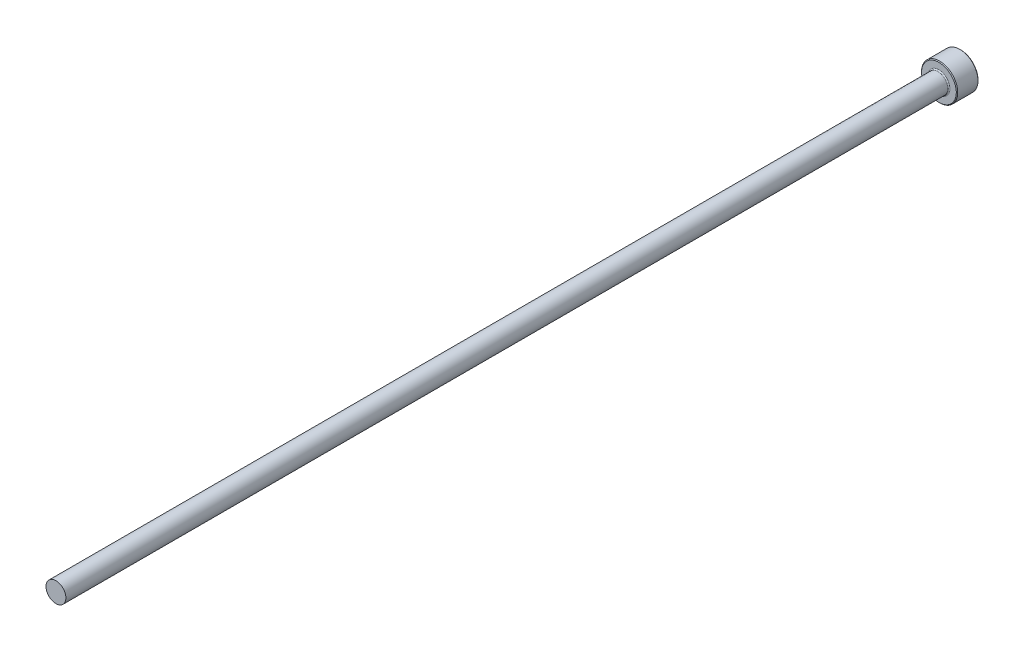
ISO-10303-21;
HEADER;
FILE_DESCRIPTION(('STEP AP214'),'2;1');
FILE_NAME('part.step','',(''),(''),'','','');
FILE_SCHEMA(('AUTOMOTIVE_DESIGN { 1 0 10303 214 1 1 1 1 }'));
ENDSEC;
DATA;
#1=APPLICATION_CONTEXT('core data for automotive mechanical design processes');
#2=APPLICATION_PROTOCOL_DEFINITION('international standard','automotive_design',2000,#1);
#3=PRODUCT_CONTEXT('',#1,'mechanical');
#4=PRODUCT('Part','Part','',(#3));
#5=PRODUCT_RELATED_PRODUCT_CATEGORY('part','',(#4));
#6=PRODUCT_DEFINITION_FORMATION('','',#4);
#7=PRODUCT_DEFINITION_CONTEXT('part definition',#1,'design');
#8=PRODUCT_DEFINITION('design','',#6,#7);
#9=PRODUCT_DEFINITION_SHAPE('','',#8);
#10=(LENGTH_UNIT() NAMED_UNIT(*) SI_UNIT(.MILLI.,.METRE.));
#11=(NAMED_UNIT(*) PLANE_ANGLE_UNIT() SI_UNIT($,.RADIAN.));
#12=(NAMED_UNIT(*) SI_UNIT($,.STERADIAN.) SOLID_ANGLE_UNIT());
#13=UNCERTAINTY_MEASURE_WITH_UNIT(LENGTH_MEASURE(1.E-05),#10,'distance_accuracy_value','');
#14=(GEOMETRIC_REPRESENTATION_CONTEXT(3) GLOBAL_UNCERTAINTY_ASSIGNED_CONTEXT((#13)) GLOBAL_UNIT_ASSIGNED_CONTEXT((#10,
#11,#12)) REPRESENTATION_CONTEXT('',''));
#15=CARTESIAN_POINT('',(0.,0.,0.));
#16=DIRECTION('',(0.,0.,1.));
#17=DIRECTION('',(1.,0.,0.));
#18=AXIS2_PLACEMENT_3D('',#15,#16,#17);
#19=CARTESIAN_POINT('',(0.,2.74999999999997,250.));
#20=DIRECTION('',(0.,0.,-1.));
#21=DIRECTION('',(-1.,0.,0.));
#22=AXIS2_PLACEMENT_3D('',#19,#20,#21);
#23=PLANE('',#22);
#24=CARTESIAN_POINT('',(0.,0.,250.));
#25=DIRECTION('',(0.,0.,1.));
#26=DIRECTION('',(1.,0.,0.));
#27=AXIS2_PLACEMENT_3D('',#24,#25,#26);
#28=CIRCLE('',#27,2.74999999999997);
#29=CARTESIAN_POINT('',(2.74999999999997,0.,250.));
#30=VERTEX_POINT('',#29);
#31=EDGE_CURVE('E50',#30,#30,#28,.T.);
#32=ORIENTED_EDGE('',*,*,#31,.T.);
#33=EDGE_LOOP('',(#32));
#34=FACE_BOUND('',#33,.T.);
#35=ADVANCED_FACE('F30',(#34),#23,.F.);
#36=CARTESIAN_POINT('',(0.,0.,109.050628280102));
#37=DIRECTION('',(0.,0.,1.));
#38=DIRECTION('',(1.,0.,0.));
#39=AXIS2_PLACEMENT_3D('',#36,#37,#38);
#40=CYLINDRICAL_SURFACE('',#39,2.74999999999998);
#41=ORIENTED_EDGE('',*,*,#31,.F.);
#42=EDGE_LOOP('',(#41));
#43=FACE_BOUND('',#42,.T.);
#44=CARTESIAN_POINT('',(0.,0.,6.3));
#45=DIRECTION('',(0.,0.,1.));
#46=DIRECTION('',(1.,0.,0.));
#47=AXIS2_PLACEMENT_3D('',#44,#45,#46);
#48=CIRCLE('',#47,2.75);
#49=CARTESIAN_POINT('',(2.75,0.,6.3));
#50=VERTEX_POINT('',#49);
#51=EDGE_CURVE('E53',#50,#50,#48,.T.);
#52=ORIENTED_EDGE('',*,*,#51,.T.);
#53=EDGE_LOOP('',(#52));
#54=FACE_BOUND('',#53,.T.);
#55=ADVANCED_FACE('F73',(#43,#54),#40,.T.);
#56=CARTESIAN_POINT('',(0.,0.,6.3));
#57=DIRECTION('',(0.,0.,1.));
#58=DIRECTION('',(1.,0.,0.));
#59=AXIS2_PLACEMENT_3D('',#56,#57,#58);
#60=TOROIDAL_SURFACE('',#59,3.05,0.3);
#61=ORIENTED_EDGE('',*,*,#51,.F.);
#62=EDGE_LOOP('',(#61));
#63=FACE_BOUND('',#62,.T.);
#64=CARTESIAN_POINT('',(0.,0.,6.00000000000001));
#65=DIRECTION('',(0.,0.,1.));
#66=DIRECTION('',(1.,0.,0.));
#67=AXIS2_PLACEMENT_3D('',#64,#65,#66);
#68=CIRCLE('',#67,3.05);
#69=CARTESIAN_POINT('',(3.05,0.,6.00000000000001));
#70=VERTEX_POINT('',#69);
#71=EDGE_CURVE('E56',#70,#70,#68,.T.);
#72=ORIENTED_EDGE('',*,*,#71,.T.);
#73=EDGE_LOOP('',(#72));
#74=FACE_BOUND('',#73,.T.);
#75=ADVANCED_FACE('F60',(#63,#74),#60,.F.);
#76=CARTESIAN_POINT('',(0.,5.,6.));
#77=DIRECTION('',(0.,0.,-1.));
#78=DIRECTION('',(-1.,0.,0.));
#79=AXIS2_PLACEMENT_3D('',#76,#77,#78);
#80=PLANE('',#79);
#81=CARTESIAN_POINT('',(0.,0.,6.));
#82=DIRECTION('',(0.,0.,-1.));
#83=DIRECTION('',(-1.,0.,0.));
#84=AXIS2_PLACEMENT_3D('',#81,#82,#83);
#85=CIRCLE('',#84,4.79999999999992);
#86=CARTESIAN_POINT('',(-4.79999999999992,0.,6.));
#87=VERTEX_POINT('',#86);
#88=EDGE_CURVE('E10',#87,#87,#85,.F.);
#89=ORIENTED_EDGE('',*,*,#88,.T.);
#90=EDGE_LOOP('',(#89));
#91=FACE_BOUND('',#90,.T.);
#92=ORIENTED_EDGE('',*,*,#71,.F.);
#93=EDGE_LOOP('',(#92));
#94=FACE_BOUND('',#93,.T.);
#95=ADVANCED_FACE('F62',(#91,#94),#80,.F.);
#96=CARTESIAN_POINT('',(0.,0.,109.050628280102));
#97=DIRECTION('',(0.,0.,1.));
#98=DIRECTION('',(1.,0.,0.));
#99=AXIS2_PLACEMENT_3D('',#96,#97,#98);
#100=CYLINDRICAL_SURFACE('',#99,5.);
#101=CARTESIAN_POINT('',(0.,0.,0.200000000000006));
#102=DIRECTION('',(0.,0.,1.));
#103=DIRECTION('',(1.,0.,0.));
#104=AXIS2_PLACEMENT_3D('',#101,#102,#103);
#105=CIRCLE('',#104,5.);
#106=CARTESIAN_POINT('',(5.,0.,0.200000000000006));
#107=VERTEX_POINT('',#106);
#108=EDGE_CURVE('E41',#107,#107,#105,.T.);
#109=ORIENTED_EDGE('',*,*,#108,.T.);
#110=EDGE_LOOP('',(#109));
#111=FACE_BOUND('',#110,.T.);
#112=CARTESIAN_POINT('',(0.,0.,5.79999999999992));
#113=DIRECTION('',(0.,0.,-1.));
#114=DIRECTION('',(-1.,0.,0.));
#115=AXIS2_PLACEMENT_3D('',#112,#113,#114);
#116=CIRCLE('',#115,5.);
#117=CARTESIAN_POINT('',(-5.,0.,5.79999999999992));
#118=VERTEX_POINT('',#117);
#119=EDGE_CURVE('E45',#118,#118,#116,.T.);
#120=ORIENTED_EDGE('',*,*,#119,.T.);
#121=EDGE_LOOP('',(#120));
#122=FACE_BOUND('',#121,.T.);
#123=ADVANCED_FACE('F64',(#111,#122),#100,.T.);
#124=CARTESIAN_POINT('',(0.,0.,0.));
#125=DIRECTION('',(0.,0.,1.));
#126=DIRECTION('',(1.,0.,0.));
#127=AXIS2_PLACEMENT_3D('',#124,#125,#126);
#128=PLANE('',#127);
#129=CARTESIAN_POINT('',(0.,0.,0.));
#130=DIRECTION('',(0.,0.,1.));
#131=DIRECTION('',(1.,0.,0.));
#132=AXIS2_PLACEMENT_3D('',#129,#130,#131);
#133=CIRCLE('',#132,4.8);
#134=CARTESIAN_POINT('',(4.8,0.,0.));
#135=VERTEX_POINT('',#134);
#136=EDGE_CURVE('E37',#135,#135,#133,.F.);
#137=ORIENTED_EDGE('',*,*,#136,.T.);
#138=EDGE_LOOP('',(#137));
#139=FACE_BOUND('',#138,.T.);
#140=ADVANCED_FACE('F70',(#139),#128,.F.);
#141=CARTESIAN_POINT('',(0.,0.,0.200000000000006));
#142=DIRECTION('',(0.,0.,1.));
#143=DIRECTION('',(1.,0.,0.));
#144=AXIS2_PLACEMENT_3D('',#141,#142,#143);
#145=CONICAL_SURFACE('',#144,5.,0.785398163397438);
#146=ORIENTED_EDGE('',*,*,#136,.F.);
#147=EDGE_LOOP('',(#146));
#148=FACE_BOUND('',#147,.T.);
#149=ORIENTED_EDGE('',*,*,#108,.F.);
#150=EDGE_LOOP('',(#149));
#151=FACE_BOUND('',#150,.T.);
#152=ADVANCED_FACE('F84',(#148,#151),#145,.T.);
#153=CARTESIAN_POINT('',(0.,0.,6.00000000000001));
#154=DIRECTION('',(0.,0.,-1.));
#155=DIRECTION('',(-1.,0.,0.));
#156=AXIS2_PLACEMENT_3D('',#153,#154,#155);
#157=CONICAL_SURFACE('',#156,4.79999999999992,0.785398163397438);
#158=ORIENTED_EDGE('',*,*,#119,.F.);
#159=EDGE_LOOP('',(#158));
#160=FACE_BOUND('',#159,.T.);
#161=ORIENTED_EDGE('',*,*,#88,.F.);
#162=EDGE_LOOP('',(#161));
#163=FACE_BOUND('',#162,.T.);
#164=ADVANCED_FACE('F32',(#160,#163),#157,.T.);
#165=CLOSED_SHELL('',(#35,#55,#75,#95,#123,#140,#152,#164));
#166=MANIFOLD_SOLID_BREP('B2',#165);
#167=ADVANCED_BREP_SHAPE_REPRESENTATION('',(#18,#166),#14);
#168=SHAPE_DEFINITION_REPRESENTATION(#9,#167);
ENDSEC;
END-ISO-10303-21;
